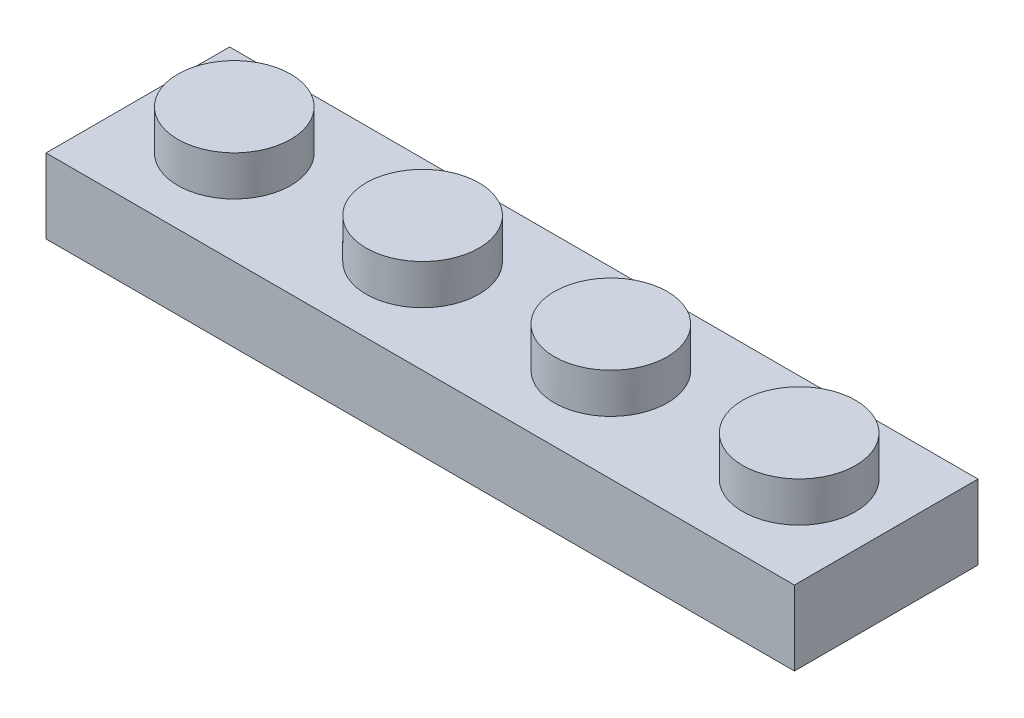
ISO-10303-21;
HEADER;
FILE_DESCRIPTION(('STEP AP214'),'2;1');
FILE_NAME('part.step','',(''),(''),'','','');
FILE_SCHEMA(('AUTOMOTIVE_DESIGN { 1 0 10303 214 1 1 1 1 }'));
ENDSEC;
DATA;
#1=APPLICATION_CONTEXT('core data for automotive mechanical design processes');
#2=APPLICATION_PROTOCOL_DEFINITION('international standard','automotive_design',2000,#1);
#3=PRODUCT_CONTEXT('',#1,'mechanical');
#4=PRODUCT('Part','Part','',(#3));
#5=PRODUCT_RELATED_PRODUCT_CATEGORY('part','',(#4));
#6=PRODUCT_DEFINITION_FORMATION('','',#4);
#7=PRODUCT_DEFINITION_CONTEXT('part definition',#1,'design');
#8=PRODUCT_DEFINITION('design','',#6,#7);
#9=PRODUCT_DEFINITION_SHAPE('','',#8);
#10=(LENGTH_UNIT() NAMED_UNIT(*) SI_UNIT(.MILLI.,.METRE.));
#11=(NAMED_UNIT(*) PLANE_ANGLE_UNIT() SI_UNIT($,.RADIAN.));
#12=(NAMED_UNIT(*) SI_UNIT($,.STERADIAN.) SOLID_ANGLE_UNIT());
#13=UNCERTAINTY_MEASURE_WITH_UNIT(LENGTH_MEASURE(1.E-05),#10,'distance_accuracy_value','');
#14=(GEOMETRIC_REPRESENTATION_CONTEXT(3) GLOBAL_UNCERTAINTY_ASSIGNED_CONTEXT((#13)) GLOBAL_UNIT_ASSIGNED_CONTEXT((#10,
#11,#12)) REPRESENTATION_CONTEXT('',''));
#15=CARTESIAN_POINT('',(0.,0.,0.));
#16=DIRECTION('',(0.,0.,1.));
#17=DIRECTION('',(1.,0.,0.));
#18=AXIS2_PLACEMENT_3D('',#15,#16,#17);
#19=CARTESIAN_POINT('',(0.,3.166,-7.8));
#20=DIRECTION('',(0.,-1.,0.));
#21=DIRECTION('',(0.,0.,-1.));
#22=AXIS2_PLACEMENT_3D('',#19,#20,#21);
#23=PLANE('',#22);
#24=CARTESIAN_POINT('',(20.,3.166,-4.));
#25=DIRECTION('',(0.,-1.,0.));
#26=DIRECTION('',(0.,0.,-1.));
#27=AXIS2_PLACEMENT_3D('',#24,#25,#26);
#28=CIRCLE('',#27,2.4);
#29=CARTESIAN_POINT('',(20.,3.166,-6.4));
#30=VERTEX_POINT('',#29);
#31=EDGE_CURVE('E296',#30,#30,#28,.F.);
#32=ORIENTED_EDGE('',*,*,#31,.F.);
#33=EDGE_LOOP('',(#32));
#34=FACE_BOUND('',#33,.T.);
#35=CARTESIAN_POINT('',(4.,3.166,-4.));
#36=DIRECTION('',(0.,-1.,0.));
#37=DIRECTION('',(0.,0.,-1.));
#38=AXIS2_PLACEMENT_3D('',#35,#36,#37);
#39=CIRCLE('',#38,2.4);
#40=CARTESIAN_POINT('',(4.,3.166,-6.4));
#41=VERTEX_POINT('',#40);
#42=EDGE_CURVE('E290',#41,#41,#39,.F.);
#43=ORIENTED_EDGE('',*,*,#42,.F.);
#44=EDGE_LOOP('',(#43));
#45=FACE_BOUND('',#44,.T.);
#46=DIRECTION('',(0.,0.,1.));
#47=VECTOR('',#46,1.);
#48=CARTESIAN_POINT('',(0.,3.166,0.));
#49=LINE('',#48,#47);
#50=CARTESIAN_POINT('',(0.,3.166,-7.8));
#51=VERTEX_POINT('',#50);
#52=CARTESIAN_POINT('',(0.,3.166,0.));
#53=VERTEX_POINT('',#52);
#54=EDGE_CURVE('E261',#51,#53,#49,.T.);
#55=ORIENTED_EDGE('',*,*,#54,.T.);
#56=DIRECTION('',(1.,0.,0.));
#57=VECTOR('',#56,1.);
#58=CARTESIAN_POINT('',(0.,3.166,0.));
#59=LINE('',#58,#57);
#60=CARTESIAN_POINT('',(31.8,3.166,0.));
#61=VERTEX_POINT('',#60);
#62=EDGE_CURVE('E264',#53,#61,#59,.T.);
#63=ORIENTED_EDGE('',*,*,#62,.T.);
#64=DIRECTION('',(0.,0.,-1.));
#65=VECTOR('',#64,1.);
#66=CARTESIAN_POINT('',(31.8,3.166,0.));
#67=LINE('',#66,#65);
#68=CARTESIAN_POINT('',(31.8,3.166,-7.8));
#69=VERTEX_POINT('',#68);
#70=EDGE_CURVE('E267',#61,#69,#67,.T.);
#71=ORIENTED_EDGE('',*,*,#70,.T.);
#72=DIRECTION('',(-1.,0.,0.));
#73=VECTOR('',#72,1.);
#74=CARTESIAN_POINT('',(0.,3.166,-7.8));
#75=LINE('',#74,#73);
#76=EDGE_CURVE('E269',#69,#51,#75,.T.);
#77=ORIENTED_EDGE('',*,*,#76,.T.);
#78=EDGE_LOOP('',(#55,#63,#71,#77));
#79=FACE_BOUND('',#78,.T.);
#80=CARTESIAN_POINT('',(12.,3.166,-4.));
#81=DIRECTION('',(0.,-1.,0.));
#82=DIRECTION('',(0.,0.,-1.));
#83=AXIS2_PLACEMENT_3D('',#80,#81,#82);
#84=CIRCLE('',#83,2.4);
#85=CARTESIAN_POINT('',(12.,3.166,-6.4));
#86=VERTEX_POINT('',#85);
#87=EDGE_CURVE('E293',#86,#86,#84,.F.);
#88=ORIENTED_EDGE('',*,*,#87,.F.);
#89=EDGE_LOOP('',(#88));
#90=FACE_BOUND('',#89,.T.);
#91=CARTESIAN_POINT('',(28.,3.166,-4.));
#92=DIRECTION('',(0.,-1.,0.));
#93=DIRECTION('',(0.,0.,-1.));
#94=AXIS2_PLACEMENT_3D('',#91,#92,#93);
#95=CIRCLE('',#94,2.4);
#96=CARTESIAN_POINT('',(28.,3.166,-6.4));
#97=VERTEX_POINT('',#96);
#98=EDGE_CURVE('E299',#97,#97,#95,.F.);
#99=ORIENTED_EDGE('',*,*,#98,.F.);
#100=EDGE_LOOP('',(#99));
#101=FACE_BOUND('',#100,.T.);
#102=ADVANCED_FACE('F37',(#34,#45,#79,#90,#101),#23,.F.);
#103=CARTESIAN_POINT('',(0.,3.166,0.));
#104=DIRECTION('',(1.,0.,0.));
#105=DIRECTION('',(0.,0.,-1.));
#106=AXIS2_PLACEMENT_3D('',#103,#104,#105);
#107=PLANE('',#106);
#108=DIRECTION('',(0.,0.,1.));
#109=VECTOR('',#108,1.);
#110=CARTESIAN_POINT('',(0.,0.,0.));
#111=LINE('',#110,#109);
#112=CARTESIAN_POINT('',(0.,0.,-7.8));
#113=VERTEX_POINT('',#112);
#114=CARTESIAN_POINT('',(0.,0.,0.));
#115=VERTEX_POINT('',#114);
#116=EDGE_CURVE('E260',#113,#115,#111,.T.);
#117=ORIENTED_EDGE('',*,*,#116,.T.);
#118=DIRECTION('',(0.,-1.,0.));
#119=VECTOR('',#118,1.);
#120=CARTESIAN_POINT('',(0.,3.166,0.));
#121=LINE('',#120,#119);
#122=EDGE_CURVE('E287',#53,#115,#121,.T.);
#123=ORIENTED_EDGE('',*,*,#122,.F.);
#124=ORIENTED_EDGE('',*,*,#54,.F.);
#125=DIRECTION('',(0.,-1.,0.));
#126=VECTOR('',#125,1.);
#127=CARTESIAN_POINT('',(0.,3.166,-7.8));
#128=LINE('',#127,#126);
#129=EDGE_CURVE('E271',#51,#113,#128,.T.);
#130=ORIENTED_EDGE('',*,*,#129,.T.);
#131=EDGE_LOOP('',(#117,#123,#124,#130));
#132=FACE_BOUND('',#131,.T.);
#133=ADVANCED_FACE('F389',(#132),#107,.F.);
#134=CARTESIAN_POINT('',(0.,3.166,0.));
#135=DIRECTION('',(0.,0.,-1.));
#136=DIRECTION('',(-1.,0.,0.));
#137=AXIS2_PLACEMENT_3D('',#134,#135,#136);
#138=PLANE('',#137);
#139=DIRECTION('',(1.,0.,0.));
#140=VECTOR('',#139,1.);
#141=CARTESIAN_POINT('',(0.,0.,0.));
#142=LINE('',#141,#140);
#143=CARTESIAN_POINT('',(31.8,0.,0.));
#144=VERTEX_POINT('',#143);
#145=EDGE_CURVE('E274',#115,#144,#142,.T.);
#146=ORIENTED_EDGE('',*,*,#145,.T.);
#147=DIRECTION('',(0.,-1.,0.));
#148=VECTOR('',#147,1.);
#149=CARTESIAN_POINT('',(31.8,3.166,0.));
#150=LINE('',#149,#148);
#151=EDGE_CURVE('E284',#61,#144,#150,.T.);
#152=ORIENTED_EDGE('',*,*,#151,.F.);
#153=ORIENTED_EDGE('',*,*,#62,.F.);
#154=ORIENTED_EDGE('',*,*,#122,.T.);
#155=EDGE_LOOP('',(#146,#152,#153,#154));
#156=FACE_BOUND('',#155,.T.);
#157=ADVANCED_FACE('F394',(#156),#138,.F.);
#158=CARTESIAN_POINT('',(31.8,3.166,0.));
#159=DIRECTION('',(-1.,0.,0.));
#160=DIRECTION('',(0.,0.,1.));
#161=AXIS2_PLACEMENT_3D('',#158,#159,#160);
#162=PLANE('',#161);
#163=DIRECTION('',(0.,0.,-1.));
#164=VECTOR('',#163,1.);
#165=CARTESIAN_POINT('',(31.8,0.,0.));
#166=LINE('',#165,#164);
#167=CARTESIAN_POINT('',(31.8,0.,-7.8));
#168=VERTEX_POINT('',#167);
#169=EDGE_CURVE('E276',#144,#168,#166,.T.);
#170=ORIENTED_EDGE('',*,*,#169,.T.);
#171=DIRECTION('',(0.,-1.,0.));
#172=VECTOR('',#171,1.);
#173=CARTESIAN_POINT('',(31.8,3.166,-7.8));
#174=LINE('',#173,#172);
#175=EDGE_CURVE('E281',#69,#168,#174,.T.);
#176=ORIENTED_EDGE('',*,*,#175,.F.);
#177=ORIENTED_EDGE('',*,*,#70,.F.);
#178=ORIENTED_EDGE('',*,*,#151,.T.);
#179=EDGE_LOOP('',(#170,#176,#177,#178));
#180=FACE_BOUND('',#179,.T.);
#181=ADVANCED_FACE('F383',(#180),#162,.F.);
#182=CARTESIAN_POINT('',(0.,3.166,-7.8));
#183=DIRECTION('',(0.,0.,1.));
#184=DIRECTION('',(1.,0.,0.));
#185=AXIS2_PLACEMENT_3D('',#182,#183,#184);
#186=PLANE('',#185);
#187=DIRECTION('',(-1.,0.,0.));
#188=VECTOR('',#187,1.);
#189=CARTESIAN_POINT('',(0.,0.,-7.8));
#190=LINE('',#189,#188);
#191=EDGE_CURVE('E265',#168,#113,#190,.T.);
#192=ORIENTED_EDGE('',*,*,#191,.T.);
#193=ORIENTED_EDGE('',*,*,#129,.F.);
#194=ORIENTED_EDGE('',*,*,#76,.F.);
#195=ORIENTED_EDGE('',*,*,#175,.T.);
#196=EDGE_LOOP('',(#192,#193,#194,#195));
#197=FACE_BOUND('',#196,.T.);
#198=ADVANCED_FACE('F373',(#197),#186,.F.);
#199=CARTESIAN_POINT('',(0.,0.,-7.8));
#200=DIRECTION('',(0.,-1.,0.));
#201=DIRECTION('',(0.,0.,-1.));
#202=AXIS2_PLACEMENT_3D('',#199,#200,#201);
#203=PLANE('',#202);
#204=DIRECTION('',(0.,0.,-1.));
#205=VECTOR('',#204,1.);
#206=CARTESIAN_POINT('',(17.55,0.,-1.55));
#207=LINE('',#206,#205);
#208=CARTESIAN_POINT('',(17.55,0.,-1.55));
#209=VERTEX_POINT('',#208);
#210=CARTESIAN_POINT('',(17.55,0.,-6.35));
#211=VERTEX_POINT('',#210);
#212=EDGE_CURVE('E201',#209,#211,#207,.T.);
#213=ORIENTED_EDGE('',*,*,#212,.F.);
#214=DIRECTION('',(-1.,0.,0.));
#215=VECTOR('',#214,1.);
#216=CARTESIAN_POINT('',(17.55,0.,-1.55));
#217=LINE('',#216,#215);
#218=CARTESIAN_POINT('',(22.35,0.,-1.55));
#219=VERTEX_POINT('',#218);
#220=EDGE_CURVE('E211',#219,#209,#217,.T.);
#221=ORIENTED_EDGE('',*,*,#220,.F.);
#222=DIRECTION('',(0.,0.,1.));
#223=VECTOR('',#222,1.);
#224=CARTESIAN_POINT('',(22.35,0.,-1.55));
#225=LINE('',#224,#223);
#226=CARTESIAN_POINT('',(22.35,0.,-6.35));
#227=VERTEX_POINT('',#226);
#228=EDGE_CURVE('E202',#227,#219,#225,.T.);
#229=ORIENTED_EDGE('',*,*,#228,.F.);
#230=DIRECTION('',(1.,0.,0.));
#231=VECTOR('',#230,1.);
#232=CARTESIAN_POINT('',(17.55,0.,-6.35));
#233=LINE('',#232,#231);
#234=EDGE_CURVE('E187',#211,#227,#233,.T.);
#235=ORIENTED_EDGE('',*,*,#234,.F.);
#236=EDGE_LOOP('',(#213,#221,#229,#235));
#237=FACE_BOUND('',#236,.T.);
#238=DIRECTION('',(0.,0.,-1.));
#239=VECTOR('',#238,1.);
#240=CARTESIAN_POINT('',(25.55,0.,-1.55));
#241=LINE('',#240,#239);
#242=CARTESIAN_POINT('',(25.55,0.,-1.55));
#243=VERTEX_POINT('',#242);
#244=CARTESIAN_POINT('',(25.55,0.,-6.35));
#245=VERTEX_POINT('',#244);
#246=EDGE_CURVE('E225',#243,#245,#241,.T.);
#247=ORIENTED_EDGE('',*,*,#246,.F.);
#248=DIRECTION('',(-1.,0.,0.));
#249=VECTOR('',#248,1.);
#250=CARTESIAN_POINT('',(25.55,0.,-1.55));
#251=LINE('',#250,#249);
#252=CARTESIAN_POINT('',(30.35,0.,-1.55));
#253=VERTEX_POINT('',#252);
#254=EDGE_CURVE('E230',#253,#243,#251,.T.);
#255=ORIENTED_EDGE('',*,*,#254,.F.);
#256=DIRECTION('',(0.,0.,1.));
#257=VECTOR('',#256,1.);
#258=CARTESIAN_POINT('',(30.35,0.,-1.55));
#259=LINE('',#258,#257);
#260=CARTESIAN_POINT('',(30.35,0.,-6.35));
#261=VERTEX_POINT('',#260);
#262=EDGE_CURVE('E244',#261,#253,#259,.T.);
#263=ORIENTED_EDGE('',*,*,#262,.F.);
#264=DIRECTION('',(1.,0.,0.));
#265=VECTOR('',#264,1.);
#266=CARTESIAN_POINT('',(25.55,0.,-6.35));
#267=LINE('',#266,#265);
#268=EDGE_CURVE('E241',#245,#261,#267,.T.);
#269=ORIENTED_EDGE('',*,*,#268,.F.);
#270=EDGE_LOOP('',(#247,#255,#263,#269));
#271=FACE_BOUND('',#270,.T.);
#272=ORIENTED_EDGE('',*,*,#116,.F.);
#273=ORIENTED_EDGE('',*,*,#191,.F.);
#274=ORIENTED_EDGE('',*,*,#169,.F.);
#275=ORIENTED_EDGE('',*,*,#145,.F.);
#276=EDGE_LOOP('',(#272,#273,#274,#275));
#277=FACE_BOUND('',#276,.T.);
#278=DIRECTION('',(0.,0.,-1.));
#279=VECTOR('',#278,1.);
#280=CARTESIAN_POINT('',(9.55,0.,-1.55));
#281=LINE('',#280,#279);
#282=CARTESIAN_POINT('',(9.55,0.,-1.55));
#283=VERTEX_POINT('',#282);
#284=CARTESIAN_POINT('',(9.55,0.,-6.35));
#285=VERTEX_POINT('',#284);
#286=EDGE_CURVE('E302',#283,#285,#281,.T.);
#287=ORIENTED_EDGE('',*,*,#286,.F.);
#288=DIRECTION('',(-1.,0.,0.));
#289=VECTOR('',#288,1.);
#290=CARTESIAN_POINT('',(9.55,0.,-1.55));
#291=LINE('',#290,#289);
#292=CARTESIAN_POINT('',(14.35,0.,-1.55));
#293=VERTEX_POINT('',#292);
#294=EDGE_CURVE('E304',#293,#283,#291,.T.);
#295=ORIENTED_EDGE('',*,*,#294,.F.);
#296=DIRECTION('',(0.,0.,1.));
#297=VECTOR('',#296,1.);
#298=CARTESIAN_POINT('',(14.35,0.,-1.55));
#299=LINE('',#298,#297);
#300=CARTESIAN_POINT('',(14.35,0.,-6.35));
#301=VERTEX_POINT('',#300);
#302=EDGE_CURVE('E307',#301,#293,#299,.T.);
#303=ORIENTED_EDGE('',*,*,#302,.F.);
#304=DIRECTION('',(1.,0.,0.));
#305=VECTOR('',#304,1.);
#306=CARTESIAN_POINT('',(9.55,0.,-6.35));
#307=LINE('',#306,#305);
#308=EDGE_CURVE('E310',#285,#301,#307,.T.);
#309=ORIENTED_EDGE('',*,*,#308,.F.);
#310=EDGE_LOOP('',(#287,#295,#303,#309));
#311=FACE_BOUND('',#310,.T.);
#312=DIRECTION('',(0.,0.,-1.));
#313=VECTOR('',#312,1.);
#314=CARTESIAN_POINT('',(1.55,0.,-1.55));
#315=LINE('',#314,#313);
#316=CARTESIAN_POINT('',(1.55,0.,-1.55));
#317=VERTEX_POINT('',#316);
#318=CARTESIAN_POINT('',(1.55,0.,-6.35));
#319=VERTEX_POINT('',#318);
#320=EDGE_CURVE('E337',#317,#319,#315,.T.);
#321=ORIENTED_EDGE('',*,*,#320,.F.);
#322=DIRECTION('',(-1.,0.,0.));
#323=VECTOR('',#322,1.);
#324=CARTESIAN_POINT('',(1.55,0.,-1.55));
#325=LINE('',#324,#323);
#326=CARTESIAN_POINT('',(6.35,0.,-1.55));
#327=VERTEX_POINT('',#326);
#328=EDGE_CURVE('E339',#327,#317,#325,.T.);
#329=ORIENTED_EDGE('',*,*,#328,.F.);
#330=DIRECTION('',(0.,0.,1.));
#331=VECTOR('',#330,1.);
#332=CARTESIAN_POINT('',(6.35,0.,-1.55));
#333=LINE('',#332,#331);
#334=CARTESIAN_POINT('',(6.35,0.,-6.35));
#335=VERTEX_POINT('',#334);
#336=EDGE_CURVE('E342',#335,#327,#333,.T.);
#337=ORIENTED_EDGE('',*,*,#336,.F.);
#338=DIRECTION('',(1.,0.,0.));
#339=VECTOR('',#338,1.);
#340=CARTESIAN_POINT('',(1.55,0.,-6.35));
#341=LINE('',#340,#339);
#342=EDGE_CURVE('E345',#319,#335,#341,.T.);
#343=ORIENTED_EDGE('',*,*,#342,.F.);
#344=EDGE_LOOP('',(#321,#329,#337,#343));
#345=FACE_BOUND('',#344,.T.);
#346=ADVANCED_FACE('F370',(#237,#271,#277,#311,#345),#203,.T.);
#347=CARTESIAN_POINT('',(4.,4.866,-4.));
#348=DIRECTION('',(0.,-1.,0.));
#349=DIRECTION('',(0.,0.,-1.));
#350=AXIS2_PLACEMENT_3D('',#347,#348,#349);
#351=CYLINDRICAL_SURFACE('',#350,2.4);
#352=CARTESIAN_POINT('',(4.,4.866,-4.));
#353=DIRECTION('',(0.,1.,0.));
#354=DIRECTION('',(0.,0.,1.));
#355=AXIS2_PLACEMENT_3D('',#352,#353,#354);
#356=CIRCLE('',#355,2.4);
#357=CARTESIAN_POINT('',(4.,4.866,-1.6));
#358=VERTEX_POINT('',#357);
#359=EDGE_CURVE('E251',#358,#358,#356,.T.);
#360=ORIENTED_EDGE('',*,*,#359,.F.);
#361=EDGE_LOOP('',(#360));
#362=FACE_BOUND('',#361,.T.);
#363=ORIENTED_EDGE('',*,*,#42,.T.);
#364=EDGE_LOOP('',(#363));
#365=FACE_BOUND('',#364,.T.);
#366=ADVANCED_FACE('F372',(#362,#365),#351,.T.);
#367=CARTESIAN_POINT('',(4.,4.866,-4.));
#368=DIRECTION('',(0.,1.,0.));
#369=DIRECTION('',(0.,0.,1.));
#370=AXIS2_PLACEMENT_3D('',#367,#368,#369);
#371=PLANE('',#370);
#372=ORIENTED_EDGE('',*,*,#359,.T.);
#373=EDGE_LOOP('',(#372));
#374=FACE_BOUND('',#373,.T.);
#375=ADVANCED_FACE('F380',(#374),#371,.T.);
#376=CARTESIAN_POINT('',(25.55,1.75,-1.55));
#377=DIRECTION('',(-1.,0.,0.));
#378=DIRECTION('',(0.,0.,1.));
#379=AXIS2_PLACEMENT_3D('',#376,#377,#378);
#380=PLANE('',#379);
#381=ORIENTED_EDGE('',*,*,#246,.T.);
#382=DIRECTION('',(0.,-1.,0.));
#383=VECTOR('',#382,1.);
#384=CARTESIAN_POINT('',(25.55,1.75,-6.35));
#385=LINE('',#384,#383);
#386=CARTESIAN_POINT('',(25.55,1.75,-6.35));
#387=VERTEX_POINT('',#386);
#388=EDGE_CURVE('E239',#387,#245,#385,.T.);
#389=ORIENTED_EDGE('',*,*,#388,.F.);
#390=DIRECTION('',(0.,0.,-1.));
#391=VECTOR('',#390,1.);
#392=CARTESIAN_POINT('',(25.55,1.75,-1.55));
#393=LINE('',#392,#391);
#394=CARTESIAN_POINT('',(25.55,1.75,-1.55));
#395=VERTEX_POINT('',#394);
#396=EDGE_CURVE('E226',#395,#387,#393,.T.);
#397=ORIENTED_EDGE('',*,*,#396,.F.);
#398=DIRECTION('',(0.,-1.,0.));
#399=VECTOR('',#398,1.);
#400=CARTESIAN_POINT('',(25.55,1.75,-1.55));
#401=LINE('',#400,#399);
#402=EDGE_CURVE('E249',#395,#243,#401,.T.);
#403=ORIENTED_EDGE('',*,*,#402,.T.);
#404=EDGE_LOOP('',(#381,#389,#397,#403));
#405=FACE_BOUND('',#404,.T.);
#406=ADVANCED_FACE('F402',(#405),#380,.F.);
#407=CARTESIAN_POINT('',(25.55,1.75,-1.55));
#408=DIRECTION('',(0.,0.,1.));
#409=DIRECTION('',(1.,0.,0.));
#410=AXIS2_PLACEMENT_3D('',#407,#408,#409);
#411=PLANE('',#410);
#412=ORIENTED_EDGE('',*,*,#254,.T.);
#413=ORIENTED_EDGE('',*,*,#402,.F.);
#414=DIRECTION('',(-1.,0.,0.));
#415=VECTOR('',#414,1.);
#416=CARTESIAN_POINT('',(25.55,1.75,-1.55));
#417=LINE('',#416,#415);
#418=CARTESIAN_POINT('',(30.35,1.75,-1.55));
#419=VERTEX_POINT('',#418);
#420=EDGE_CURVE('E236',#419,#395,#417,.T.);
#421=ORIENTED_EDGE('',*,*,#420,.F.);
#422=DIRECTION('',(0.,-1.,0.));
#423=VECTOR('',#422,1.);
#424=CARTESIAN_POINT('',(30.35,1.75,-1.55));
#425=LINE('',#424,#423);
#426=EDGE_CURVE('E252',#419,#253,#425,.T.);
#427=ORIENTED_EDGE('',*,*,#426,.T.);
#428=EDGE_LOOP('',(#412,#413,#421,#427));
#429=FACE_BOUND('',#428,.T.);
#430=ADVANCED_FACE('F406',(#429),#411,.F.);
#431=CARTESIAN_POINT('',(30.35,1.75,-1.55));
#432=DIRECTION('',(1.,0.,0.));
#433=DIRECTION('',(0.,0.,-1.));
#434=AXIS2_PLACEMENT_3D('',#431,#432,#433);
#435=PLANE('',#434);
#436=ORIENTED_EDGE('',*,*,#262,.T.);
#437=ORIENTED_EDGE('',*,*,#426,.F.);
#438=DIRECTION('',(0.,0.,1.));
#439=VECTOR('',#438,1.);
#440=CARTESIAN_POINT('',(30.35,1.75,-1.55));
#441=LINE('',#440,#439);
#442=CARTESIAN_POINT('',(30.35,1.75,-6.35));
#443=VERTEX_POINT('',#442);
#444=EDGE_CURVE('E233',#443,#419,#441,.T.);
#445=ORIENTED_EDGE('',*,*,#444,.F.);
#446=DIRECTION('',(0.,-1.,0.));
#447=VECTOR('',#446,1.);
#448=CARTESIAN_POINT('',(30.35,1.75,-6.35));
#449=LINE('',#448,#447);
#450=EDGE_CURVE('E254',#443,#261,#449,.T.);
#451=ORIENTED_EDGE('',*,*,#450,.T.);
#452=EDGE_LOOP('',(#436,#437,#445,#451));
#453=FACE_BOUND('',#452,.T.);
#454=ADVANCED_FACE('F412',(#453),#435,.F.);
#455=CARTESIAN_POINT('',(25.55,1.75,-6.35));
#456=DIRECTION('',(0.,0.,-1.));
#457=DIRECTION('',(-1.,0.,0.));
#458=AXIS2_PLACEMENT_3D('',#455,#456,#457);
#459=PLANE('',#458);
#460=ORIENTED_EDGE('',*,*,#268,.T.);
#461=ORIENTED_EDGE('',*,*,#450,.F.);
#462=DIRECTION('',(1.,0.,0.));
#463=VECTOR('',#462,1.);
#464=CARTESIAN_POINT('',(25.55,1.75,-6.35));
#465=LINE('',#464,#463);
#466=EDGE_CURVE('E229',#387,#443,#465,.T.);
#467=ORIENTED_EDGE('',*,*,#466,.F.);
#468=ORIENTED_EDGE('',*,*,#388,.T.);
#469=EDGE_LOOP('',(#460,#461,#467,#468));
#470=FACE_BOUND('',#469,.T.);
#471=ADVANCED_FACE('F408',(#470),#459,.F.);
#472=CARTESIAN_POINT('',(25.55,1.75,-6.35));
#473=DIRECTION('',(0.,-1.,0.));
#474=DIRECTION('',(0.,0.,-1.));
#475=AXIS2_PLACEMENT_3D('',#472,#473,#474);
#476=PLANE('',#475);
#477=ORIENTED_EDGE('',*,*,#396,.T.);
#478=ORIENTED_EDGE('',*,*,#466,.T.);
#479=ORIENTED_EDGE('',*,*,#444,.T.);
#480=ORIENTED_EDGE('',*,*,#420,.T.);
#481=EDGE_LOOP('',(#477,#478,#479,#480));
#482=FACE_BOUND('',#481,.T.);
#483=ADVANCED_FACE('F411',(#482),#476,.T.);
#484=CARTESIAN_POINT('',(12.,4.866,-4.));
#485=DIRECTION('',(0.,-1.,0.));
#486=DIRECTION('',(0.,0.,-1.));
#487=AXIS2_PLACEMENT_3D('',#484,#485,#486);
#488=CYLINDRICAL_SURFACE('',#487,2.4);
#489=CARTESIAN_POINT('',(12.,4.866,-4.));
#490=DIRECTION('',(0.,1.,0.));
#491=DIRECTION('',(0.,0.,1.));
#492=AXIS2_PLACEMENT_3D('',#489,#490,#491);
#493=CIRCLE('',#492,2.4);
#494=CARTESIAN_POINT('',(12.,4.866,-1.6));
#495=VERTEX_POINT('',#494);
#496=EDGE_CURVE('E222',#495,#495,#493,.T.);
#497=ORIENTED_EDGE('',*,*,#496,.F.);
#498=EDGE_LOOP('',(#497));
#499=FACE_BOUND('',#498,.T.);
#500=ORIENTED_EDGE('',*,*,#87,.T.);
#501=EDGE_LOOP('',(#500));
#502=FACE_BOUND('',#501,.T.);
#503=ADVANCED_FACE('F422',(#499,#502),#488,.T.);
#504=CARTESIAN_POINT('',(12.,4.866,-4.));
#505=DIRECTION('',(0.,1.,0.));
#506=DIRECTION('',(0.,0.,1.));
#507=AXIS2_PLACEMENT_3D('',#504,#505,#506);
#508=PLANE('',#507);
#509=ORIENTED_EDGE('',*,*,#496,.T.);
#510=EDGE_LOOP('',(#509));
#511=FACE_BOUND('',#510,.T.);
#512=ADVANCED_FACE('F424',(#511),#508,.T.);
#513=CARTESIAN_POINT('',(20.,4.866,-4.));
#514=DIRECTION('',(0.,-1.,0.));
#515=DIRECTION('',(0.,0.,-1.));
#516=AXIS2_PLACEMENT_3D('',#513,#514,#515);
#517=CYLINDRICAL_SURFACE('',#516,2.4);
#518=CARTESIAN_POINT('',(20.,4.866,-4.));
#519=DIRECTION('',(0.,1.,0.));
#520=DIRECTION('',(0.,0.,1.));
#521=AXIS2_PLACEMENT_3D('',#518,#519,#520);
#522=CIRCLE('',#521,2.4);
#523=CARTESIAN_POINT('',(20.,4.866,-1.6));
#524=VERTEX_POINT('',#523);
#525=EDGE_CURVE('E219',#524,#524,#522,.T.);
#526=ORIENTED_EDGE('',*,*,#525,.F.);
#527=EDGE_LOOP('',(#526));
#528=FACE_BOUND('',#527,.T.);
#529=ORIENTED_EDGE('',*,*,#31,.T.);
#530=EDGE_LOOP('',(#529));
#531=FACE_BOUND('',#530,.T.);
#532=ADVANCED_FACE('F431',(#528,#531),#517,.T.);
#533=CARTESIAN_POINT('',(20.,4.866,-4.));
#534=DIRECTION('',(0.,1.,0.));
#535=DIRECTION('',(0.,0.,1.));
#536=AXIS2_PLACEMENT_3D('',#533,#534,#535);
#537=PLANE('',#536);
#538=ORIENTED_EDGE('',*,*,#525,.T.);
#539=EDGE_LOOP('',(#538));
#540=FACE_BOUND('',#539,.T.);
#541=ADVANCED_FACE('F428',(#540),#537,.T.);
#542=CARTESIAN_POINT('',(28.,4.866,-4.));
#543=DIRECTION('',(0.,-1.,0.));
#544=DIRECTION('',(0.,0.,-1.));
#545=AXIS2_PLACEMENT_3D('',#542,#543,#544);
#546=CYLINDRICAL_SURFACE('',#545,2.4);
#547=CARTESIAN_POINT('',(28.,4.866,-4.));
#548=DIRECTION('',(0.,1.,0.));
#549=DIRECTION('',(0.,0.,1.));
#550=AXIS2_PLACEMENT_3D('',#547,#548,#549);
#551=CIRCLE('',#550,2.4);
#552=CARTESIAN_POINT('',(28.,4.866,-1.6));
#553=VERTEX_POINT('',#552);
#554=EDGE_CURVE('E216',#553,#553,#551,.T.);
#555=ORIENTED_EDGE('',*,*,#554,.F.);
#556=EDGE_LOOP('',(#555));
#557=FACE_BOUND('',#556,.T.);
#558=ORIENTED_EDGE('',*,*,#98,.T.);
#559=EDGE_LOOP('',(#558));
#560=FACE_BOUND('',#559,.T.);
#561=ADVANCED_FACE('F439',(#557,#560),#546,.T.);
#562=CARTESIAN_POINT('',(28.,4.866,-4.));
#563=DIRECTION('',(0.,1.,0.));
#564=DIRECTION('',(0.,0.,1.));
#565=AXIS2_PLACEMENT_3D('',#562,#563,#564);
#566=PLANE('',#565);
#567=ORIENTED_EDGE('',*,*,#554,.T.);
#568=EDGE_LOOP('',(#567));
#569=FACE_BOUND('',#568,.T.);
#570=ADVANCED_FACE('F436',(#569),#566,.T.);
#571=CARTESIAN_POINT('',(17.55,1.75,-1.55));
#572=DIRECTION('',(-1.,0.,0.));
#573=DIRECTION('',(0.,0.,1.));
#574=AXIS2_PLACEMENT_3D('',#571,#572,#573);
#575=PLANE('',#574);
#576=ORIENTED_EDGE('',*,*,#212,.T.);
#577=DIRECTION('',(0.,-1.,0.));
#578=VECTOR('',#577,1.);
#579=CARTESIAN_POINT('',(17.55,1.75,-6.35));
#580=LINE('',#579,#578);
#581=CARTESIAN_POINT('',(17.55,1.75,-6.35));
#582=VERTEX_POINT('',#581);
#583=EDGE_CURVE('E193',#582,#211,#580,.T.);
#584=ORIENTED_EDGE('',*,*,#583,.F.);
#585=DIRECTION('',(0.,0.,-1.));
#586=VECTOR('',#585,1.);
#587=CARTESIAN_POINT('',(17.55,1.75,-1.55));
#588=LINE('',#587,#586);
#589=CARTESIAN_POINT('',(17.55,1.75,-1.55));
#590=VERTEX_POINT('',#589);
#591=EDGE_CURVE('E176',#590,#582,#588,.T.);
#592=ORIENTED_EDGE('',*,*,#591,.F.);
#593=DIRECTION('',(0.,-1.,0.));
#594=VECTOR('',#593,1.);
#595=CARTESIAN_POINT('',(17.55,1.75,-1.55));
#596=LINE('',#595,#594);
#597=EDGE_CURVE('E213',#590,#209,#596,.T.);
#598=ORIENTED_EDGE('',*,*,#597,.T.);
#599=EDGE_LOOP('',(#576,#584,#592,#598));
#600=FACE_BOUND('',#599,.T.);
#601=ADVANCED_FACE('F199',(#600),#575,.F.);
#602=CARTESIAN_POINT('',(17.55,1.75,-1.55));
#603=DIRECTION('',(0.,0.,1.));
#604=DIRECTION('',(1.,0.,0.));
#605=AXIS2_PLACEMENT_3D('',#602,#603,#604);
#606=PLANE('',#605);
#607=ORIENTED_EDGE('',*,*,#220,.T.);
#608=ORIENTED_EDGE('',*,*,#597,.F.);
#609=DIRECTION('',(-1.,0.,0.));
#610=VECTOR('',#609,1.);
#611=CARTESIAN_POINT('',(17.55,1.75,-1.55));
#612=LINE('',#611,#610);
#613=CARTESIAN_POINT('',(22.35,1.75,-1.55));
#614=VERTEX_POINT('',#613);
#615=EDGE_CURVE('E182',#614,#590,#612,.T.);
#616=ORIENTED_EDGE('',*,*,#615,.F.);
#617=DIRECTION('',(0.,-1.,0.));
#618=VECTOR('',#617,1.);
#619=CARTESIAN_POINT('',(22.35,1.75,-1.55));
#620=LINE('',#619,#618);
#621=EDGE_CURVE('E204',#614,#219,#620,.T.);
#622=ORIENTED_EDGE('',*,*,#621,.T.);
#623=EDGE_LOOP('',(#607,#608,#616,#622));
#624=FACE_BOUND('',#623,.T.);
#625=ADVANCED_FACE('F449',(#624),#606,.F.);
#626=CARTESIAN_POINT('',(22.35,1.75,-1.55));
#627=DIRECTION('',(1.,0.,0.));
#628=DIRECTION('',(0.,0.,-1.));
#629=AXIS2_PLACEMENT_3D('',#626,#627,#628);
#630=PLANE('',#629);
#631=ORIENTED_EDGE('',*,*,#228,.T.);
#632=ORIENTED_EDGE('',*,*,#621,.F.);
#633=DIRECTION('',(0.,0.,1.));
#634=VECTOR('',#633,1.);
#635=CARTESIAN_POINT('',(22.35,1.75,-1.55));
#636=LINE('',#635,#634);
#637=CARTESIAN_POINT('',(22.35,1.75,-6.35));
#638=VERTEX_POINT('',#637);
#639=EDGE_CURVE('E197',#638,#614,#636,.T.);
#640=ORIENTED_EDGE('',*,*,#639,.F.);
#641=DIRECTION('',(0.,-1.,0.));
#642=VECTOR('',#641,1.);
#643=CARTESIAN_POINT('',(22.35,1.75,-6.35));
#644=LINE('',#643,#642);
#645=EDGE_CURVE('E196',#638,#227,#644,.T.);
#646=ORIENTED_EDGE('',*,*,#645,.T.);
#647=EDGE_LOOP('',(#631,#632,#640,#646));
#648=FACE_BOUND('',#647,.T.);
#649=ADVANCED_FACE('F453',(#648),#630,.F.);
#650=CARTESIAN_POINT('',(17.55,1.75,-6.35));
#651=DIRECTION('',(0.,0.,-1.));
#652=DIRECTION('',(-1.,0.,0.));
#653=AXIS2_PLACEMENT_3D('',#650,#651,#652);
#654=PLANE('',#653);
#655=ORIENTED_EDGE('',*,*,#234,.T.);
#656=ORIENTED_EDGE('',*,*,#645,.F.);
#657=DIRECTION('',(1.,0.,0.));
#658=VECTOR('',#657,1.);
#659=CARTESIAN_POINT('',(17.55,1.75,-6.35));
#660=LINE('',#659,#658);
#661=EDGE_CURVE('E179',#582,#638,#660,.T.);
#662=ORIENTED_EDGE('',*,*,#661,.F.);
#663=ORIENTED_EDGE('',*,*,#583,.T.);
#664=EDGE_LOOP('',(#655,#656,#662,#663));
#665=FACE_BOUND('',#664,.T.);
#666=ADVANCED_FACE('F192',(#665),#654,.F.);
#667=CARTESIAN_POINT('',(17.55,1.75,-6.35));
#668=DIRECTION('',(0.,-1.,0.));
#669=DIRECTION('',(0.,0.,-1.));
#670=AXIS2_PLACEMENT_3D('',#667,#668,#669);
#671=PLANE('',#670);
#672=ORIENTED_EDGE('',*,*,#591,.T.);
#673=ORIENTED_EDGE('',*,*,#661,.T.);
#674=ORIENTED_EDGE('',*,*,#639,.T.);
#675=ORIENTED_EDGE('',*,*,#615,.T.);
#676=EDGE_LOOP('',(#672,#673,#674,#675));
#677=FACE_BOUND('',#676,.T.);
#678=ADVANCED_FACE('F178',(#677),#671,.T.);
#679=CARTESIAN_POINT('',(9.55,1.75,-6.35));
#680=DIRECTION('',(0.,-1.,0.));
#681=DIRECTION('',(0.,0.,-1.));
#682=AXIS2_PLACEMENT_3D('',#679,#680,#681);
#683=PLANE('',#682);
#684=DIRECTION('',(0.,0.,-1.));
#685=VECTOR('',#684,1.);
#686=CARTESIAN_POINT('',(9.55,1.75,-1.55));
#687=LINE('',#686,#685);
#688=CARTESIAN_POINT('',(9.55,1.75,-1.55));
#689=VERTEX_POINT('',#688);
#690=CARTESIAN_POINT('',(9.55,1.75,-6.35));
#691=VERTEX_POINT('',#690);
#692=EDGE_CURVE('E316',#689,#691,#687,.T.);
#693=ORIENTED_EDGE('',*,*,#692,.T.);
#694=DIRECTION('',(1.,0.,0.));
#695=VECTOR('',#694,1.);
#696=CARTESIAN_POINT('',(9.55,1.75,-6.35));
#697=LINE('',#696,#695);
#698=CARTESIAN_POINT('',(14.35,1.75,-6.35));
#699=VERTEX_POINT('',#698);
#700=EDGE_CURVE('E334',#691,#699,#697,.T.);
#701=ORIENTED_EDGE('',*,*,#700,.T.);
#702=DIRECTION('',(0.,0.,1.));
#703=VECTOR('',#702,1.);
#704=CARTESIAN_POINT('',(14.35,1.75,-1.55));
#705=LINE('',#704,#703);
#706=CARTESIAN_POINT('',(14.35,1.75,-1.55));
#707=VERTEX_POINT('',#706);
#708=EDGE_CURVE('E328',#699,#707,#705,.T.);
#709=ORIENTED_EDGE('',*,*,#708,.T.);
#710=DIRECTION('',(-1.,0.,0.));
#711=VECTOR('',#710,1.);
#712=CARTESIAN_POINT('',(9.55,1.75,-1.55));
#713=LINE('',#712,#711);
#714=EDGE_CURVE('E322',#707,#689,#713,.T.);
#715=ORIENTED_EDGE('',*,*,#714,.T.);
#716=EDGE_LOOP('',(#693,#701,#709,#715));
#717=FACE_BOUND('',#716,.T.);
#718=ADVANCED_FACE('F450',(#717),#683,.T.);
#719=CARTESIAN_POINT('',(9.55,1.75,-6.35));
#720=DIRECTION('',(0.,0.,-1.));
#721=DIRECTION('',(-1.,0.,0.));
#722=AXIS2_PLACEMENT_3D('',#719,#720,#721);
#723=PLANE('',#722);
#724=ORIENTED_EDGE('',*,*,#308,.T.);
#725=DIRECTION('',(0.,-1.,0.));
#726=VECTOR('',#725,1.);
#727=CARTESIAN_POINT('',(14.35,1.75,-6.35));
#728=LINE('',#727,#726);
#729=EDGE_CURVE('E331',#699,#301,#728,.T.);
#730=ORIENTED_EDGE('',*,*,#729,.F.);
#731=ORIENTED_EDGE('',*,*,#700,.F.);
#732=DIRECTION('',(0.,-1.,0.));
#733=VECTOR('',#732,1.);
#734=CARTESIAN_POINT('',(9.55,1.75,-6.35));
#735=LINE('',#734,#733);
#736=EDGE_CURVE('E313',#691,#285,#735,.T.);
#737=ORIENTED_EDGE('',*,*,#736,.T.);
#738=EDGE_LOOP('',(#724,#730,#731,#737));
#739=FACE_BOUND('',#738,.T.);
#740=ADVANCED_FACE('F464',(#739),#723,.F.);
#741=CARTESIAN_POINT('',(14.35,1.75,-1.55));
#742=DIRECTION('',(1.,0.,0.));
#743=DIRECTION('',(0.,0.,-1.));
#744=AXIS2_PLACEMENT_3D('',#741,#742,#743);
#745=PLANE('',#744);
#746=ORIENTED_EDGE('',*,*,#302,.T.);
#747=DIRECTION('',(0.,-1.,0.));
#748=VECTOR('',#747,1.);
#749=CARTESIAN_POINT('',(14.35,1.75,-1.55));
#750=LINE('',#749,#748);
#751=EDGE_CURVE('E325',#707,#293,#750,.T.);
#752=ORIENTED_EDGE('',*,*,#751,.F.);
#753=ORIENTED_EDGE('',*,*,#708,.F.);
#754=ORIENTED_EDGE('',*,*,#729,.T.);
#755=EDGE_LOOP('',(#746,#752,#753,#754));
#756=FACE_BOUND('',#755,.T.);
#757=ADVANCED_FACE('F470',(#756),#745,.F.);
#758=CARTESIAN_POINT('',(9.55,1.75,-1.55));
#759=DIRECTION('',(0.,0.,1.));
#760=DIRECTION('',(1.,0.,0.));
#761=AXIS2_PLACEMENT_3D('',#758,#759,#760);
#762=PLANE('',#761);
#763=ORIENTED_EDGE('',*,*,#294,.T.);
#764=DIRECTION('',(0.,-1.,0.));
#765=VECTOR('',#764,1.);
#766=CARTESIAN_POINT('',(9.55,1.75,-1.55));
#767=LINE('',#766,#765);
#768=EDGE_CURVE('E319',#689,#283,#767,.T.);
#769=ORIENTED_EDGE('',*,*,#768,.F.);
#770=ORIENTED_EDGE('',*,*,#714,.F.);
#771=ORIENTED_EDGE('',*,*,#751,.T.);
#772=EDGE_LOOP('',(#763,#769,#770,#771));
#773=FACE_BOUND('',#772,.T.);
#774=ADVANCED_FACE('F488',(#773),#762,.F.);
#775=CARTESIAN_POINT('',(9.55,1.75,-1.55));
#776=DIRECTION('',(-1.,0.,0.));
#777=DIRECTION('',(0.,0.,1.));
#778=AXIS2_PLACEMENT_3D('',#775,#776,#777);
#779=PLANE('',#778);
#780=ORIENTED_EDGE('',*,*,#286,.T.);
#781=ORIENTED_EDGE('',*,*,#736,.F.);
#782=ORIENTED_EDGE('',*,*,#692,.F.);
#783=ORIENTED_EDGE('',*,*,#768,.T.);
#784=EDGE_LOOP('',(#780,#781,#782,#783));
#785=FACE_BOUND('',#784,.T.);
#786=ADVANCED_FACE('F484',(#785),#779,.F.);
#787=CARTESIAN_POINT('',(1.55,1.75,-6.35));
#788=DIRECTION('',(0.,-1.,0.));
#789=DIRECTION('',(0.,0.,-1.));
#790=AXIS2_PLACEMENT_3D('',#787,#788,#789);
#791=PLANE('',#790);
#792=DIRECTION('',(0.,0.,-1.));
#793=VECTOR('',#792,1.);
#794=CARTESIAN_POINT('',(1.55,1.75,-1.55));
#795=LINE('',#794,#793);
#796=CARTESIAN_POINT('',(1.55,1.75,-1.55));
#797=VERTEX_POINT('',#796);
#798=CARTESIAN_POINT('',(1.55,1.75,-6.35));
#799=VERTEX_POINT('',#798);
#800=EDGE_CURVE('E351',#797,#799,#795,.T.);
#801=ORIENTED_EDGE('',*,*,#800,.T.);
#802=DIRECTION('',(1.,0.,0.));
#803=VECTOR('',#802,1.);
#804=CARTESIAN_POINT('',(1.55,1.75,-6.35));
#805=LINE('',#804,#803);
#806=CARTESIAN_POINT('',(6.35,1.75,-6.35));
#807=VERTEX_POINT('',#806);
#808=EDGE_CURVE('E11',#799,#807,#805,.T.);
#809=ORIENTED_EDGE('',*,*,#808,.T.);
#810=DIRECTION('',(0.,0.,1.));
#811=VECTOR('',#810,1.);
#812=CARTESIAN_POINT('',(6.35,1.75,-1.55));
#813=LINE('',#812,#811);
#814=CARTESIAN_POINT('',(6.35,1.75,-1.55));
#815=VERTEX_POINT('',#814);
#816=EDGE_CURVE('E52',#807,#815,#813,.T.);
#817=ORIENTED_EDGE('',*,*,#816,.T.);
#818=DIRECTION('',(-1.,0.,0.));
#819=VECTOR('',#818,1.);
#820=CARTESIAN_POINT('',(1.55,1.75,-1.55));
#821=LINE('',#820,#819);
#822=EDGE_CURVE('E60',#815,#797,#821,.T.);
#823=ORIENTED_EDGE('',*,*,#822,.T.);
#824=EDGE_LOOP('',(#801,#809,#817,#823));
#825=FACE_BOUND('',#824,.T.);
#826=ADVANCED_FACE('F39',(#825),#791,.T.);
#827=CARTESIAN_POINT('',(1.55,1.75,-6.35));
#828=DIRECTION('',(0.,0.,-1.));
#829=DIRECTION('',(-1.,0.,0.));
#830=AXIS2_PLACEMENT_3D('',#827,#828,#829);
#831=PLANE('',#830);
#832=ORIENTED_EDGE('',*,*,#342,.T.);
#833=DIRECTION('',(0.,-1.,0.));
#834=VECTOR('',#833,1.);
#835=CARTESIAN_POINT('',(6.35,1.75,-6.35));
#836=LINE('',#835,#834);
#837=EDGE_CURVE('E45',#807,#335,#836,.T.);
#838=ORIENTED_EDGE('',*,*,#837,.F.);
#839=ORIENTED_EDGE('',*,*,#808,.F.);
#840=DIRECTION('',(0.,-1.,0.));
#841=VECTOR('',#840,1.);
#842=CARTESIAN_POINT('',(1.55,1.75,-6.35));
#843=LINE('',#842,#841);
#844=EDGE_CURVE('E348',#799,#319,#843,.T.);
#845=ORIENTED_EDGE('',*,*,#844,.T.);
#846=EDGE_LOOP('',(#832,#838,#839,#845));
#847=FACE_BOUND('',#846,.T.);
#848=ADVANCED_FACE('F363',(#847),#831,.F.);
#849=CARTESIAN_POINT('',(6.35,1.75,-1.55));
#850=DIRECTION('',(1.,0.,0.));
#851=DIRECTION('',(0.,0.,-1.));
#852=AXIS2_PLACEMENT_3D('',#849,#850,#851);
#853=PLANE('',#852);
#854=ORIENTED_EDGE('',*,*,#336,.T.);
#855=DIRECTION('',(0.,-1.,0.));
#856=VECTOR('',#855,1.);
#857=CARTESIAN_POINT('',(6.35,1.75,-1.55));
#858=LINE('',#857,#856);
#859=EDGE_CURVE('E358',#815,#327,#858,.T.);
#860=ORIENTED_EDGE('',*,*,#859,.F.);
#861=ORIENTED_EDGE('',*,*,#816,.F.);
#862=ORIENTED_EDGE('',*,*,#837,.T.);
#863=EDGE_LOOP('',(#854,#860,#861,#862));
#864=FACE_BOUND('',#863,.T.);
#865=ADVANCED_FACE('F360',(#864),#853,.F.);
#866=CARTESIAN_POINT('',(1.55,1.75,-1.55));
#867=DIRECTION('',(0.,0.,1.));
#868=DIRECTION('',(1.,0.,0.));
#869=AXIS2_PLACEMENT_3D('',#866,#867,#868);
#870=PLANE('',#869);
#871=ORIENTED_EDGE('',*,*,#328,.T.);
#872=DIRECTION('',(0.,-1.,0.));
#873=VECTOR('',#872,1.);
#874=CARTESIAN_POINT('',(1.55,1.75,-1.55));
#875=LINE('',#874,#873);
#876=EDGE_CURVE('E354',#797,#317,#875,.T.);
#877=ORIENTED_EDGE('',*,*,#876,.F.);
#878=ORIENTED_EDGE('',*,*,#822,.F.);
#879=ORIENTED_EDGE('',*,*,#859,.T.);
#880=EDGE_LOOP('',(#871,#877,#878,#879));
#881=FACE_BOUND('',#880,.T.);
#882=ADVANCED_FACE('F368',(#881),#870,.F.);
#883=CARTESIAN_POINT('',(1.55,1.75,-1.55));
#884=DIRECTION('',(-1.,0.,0.));
#885=DIRECTION('',(0.,0.,1.));
#886=AXIS2_PLACEMENT_3D('',#883,#884,#885);
#887=PLANE('',#886);
#888=ORIENTED_EDGE('',*,*,#320,.T.);
#889=ORIENTED_EDGE('',*,*,#844,.F.);
#890=ORIENTED_EDGE('',*,*,#800,.F.);
#891=ORIENTED_EDGE('',*,*,#876,.T.);
#892=EDGE_LOOP('',(#888,#889,#890,#891));
#893=FACE_BOUND('',#892,.T.);
#894=ADVANCED_FACE('F367',(#893),#887,.F.);
#895=CLOSED_SHELL('',(#102,#133,#157,#181,#198,#346,#366,#375,#406,#430,#454,#471,#483,#503,
#512,#532,#541,#561,#570,#601,#625,#649,#666,#678,#718,#740,#757,#774,#786,#826,#848,#865,#882,#894));
#896=MANIFOLD_SOLID_BREP('B2',#895);
#897=ADVANCED_BREP_SHAPE_REPRESENTATION('',(#18,#896),#14);
#898=SHAPE_DEFINITION_REPRESENTATION(#9,#897);
ENDSEC;
END-ISO-10303-21;
